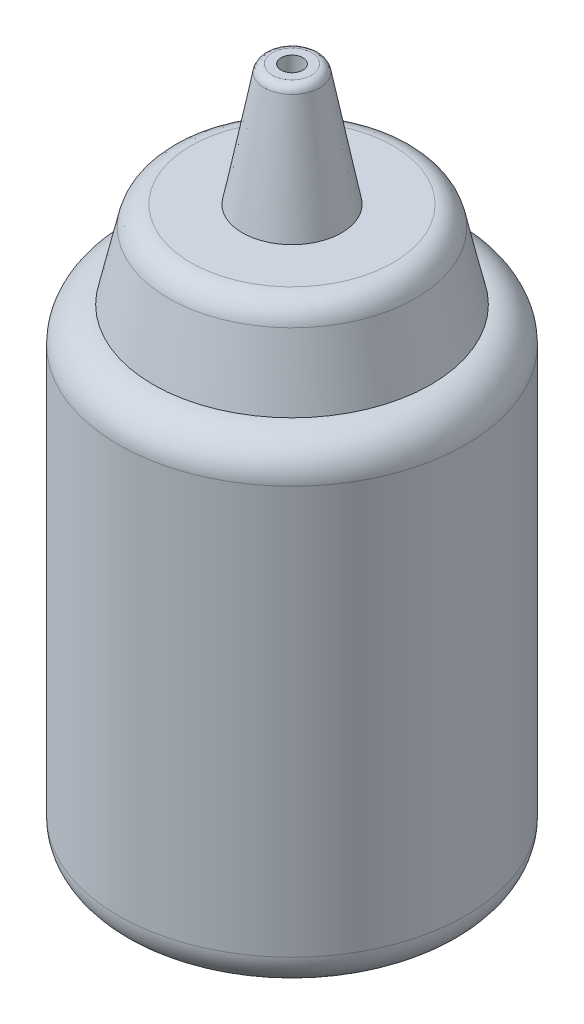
from build123d import *

# Parameters (mm, degrees)
SKETCH2_R          = 1.25
CUT_EXTRUDE1_DEPTH = 10


with BuildPart() as part:
    # Sketch1 → Revolve1 (revolve)
    with BuildSketch(Plane.XY, mode=Mode.PRIVATE) as revolve1_sk:
        with BuildLine():
            Line((-20, 51.0001), (-20, 3.9999))
            add(Edge.make_bspline(
                [(-20, 3.9999), (-20, 1.7999), (-18.2001, 0), (-16.0001, 0)],
                knots=[0.181818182, 0.181818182, 0.181818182, 0.181818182, 0.272727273, 0.272727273, 0.272727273, 0.272727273], degree=3))
            Line((-16.0001, 0), (0, 0))
            Line((0, 0), (0, 79))
            Line((0, 79), (-2.2446, 79))
            add(Edge.make_bspline(
                [(-2.2446, 79), (-2.7027, 79), (-3.0876, 78.6693), (-3.1782, 78.1978)],
                knots=[0.545454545, 0.545454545, 0.545454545, 0.545454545, 0.636363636, 0.636363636, 0.636363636, 0.636363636], degree=3))
            Line((-3.1782, 78.1978), (-5.7143, 65))
            Line((-5.7143, 65), (-11.6625, 65))
            add(Edge.make_bspline(
                [(-11.6625, 65), (-12.8979, 65), (-13.9415, 64.0876), (-14.2466, 62.7408)],
                knots=[0.818181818, 0.818181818, 0.818181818, 0.818181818, 0.909090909, 0.909090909, 0.909090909, 0.909090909], degree=3))
            Line((-14.2466, 62.7408), (-16.0001, 55))
            add(Edge.make_bspline(
                [(-16.0001, 55), (-18.2001, 55), (-20, 53.2001), (-20, 51.0001)],
                knots=[0, 0, 0, 0, 0.090909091, 0.090909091, 0.090909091, 0.090909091], degree=3))
        make_face()
    revolve(revolve1_sk.sketch.rotate(Axis((0, 0, 0), (0, 1, 0)), 270), axis=Axis((0, 0, 0), (0, 1, 0)))

    # Sketch2 → Cut-Extrude1 (cut)
    with BuildSketch(Plane(origin=(0, 79, 0), x_dir=(1, 0, 0), z_dir=(0, 1, 0))):
        with Locations(Location((0, 0, 0), (0, 0, 270))):
            Circle(SKETCH2_R)
    extrude(amount=-CUT_EXTRUDE1_DEPTH, mode=Mode.SUBTRACT)


solid = part.part
